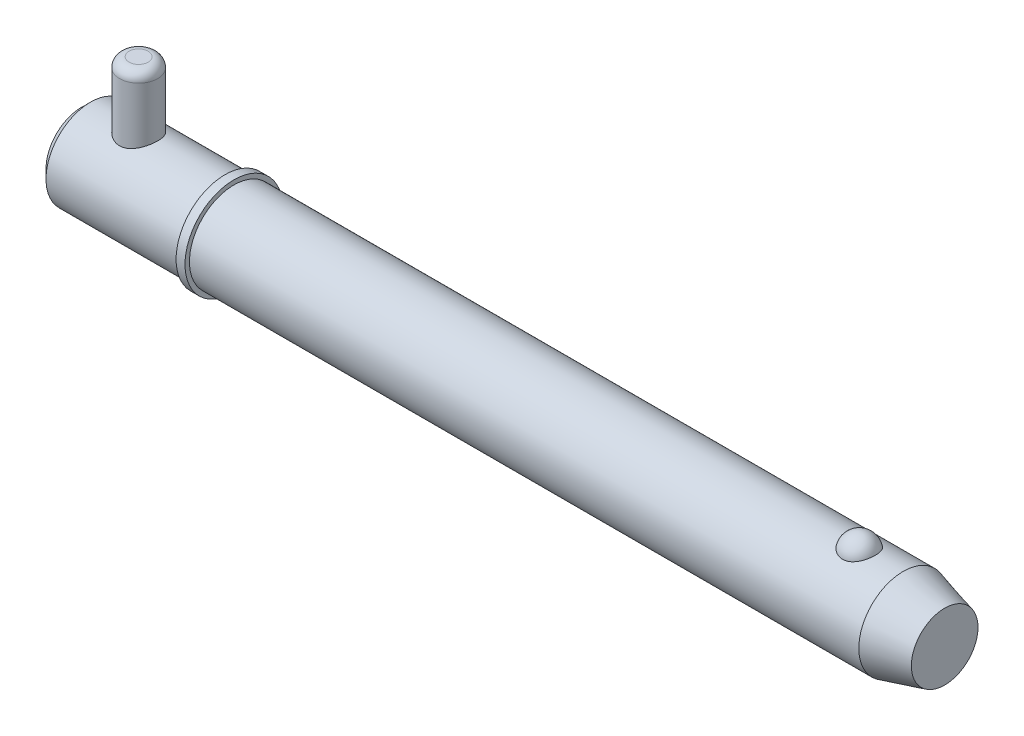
ISO-10303-21;
HEADER;
FILE_DESCRIPTION(('STEP AP214'),'2;1');
FILE_NAME('part.step','',(''),(''),'','','');
FILE_SCHEMA(('AUTOMOTIVE_DESIGN { 1 0 10303 214 1 1 1 1 }'));
ENDSEC;
DATA;
#1=APPLICATION_CONTEXT('core data for automotive mechanical design processes');
#2=APPLICATION_PROTOCOL_DEFINITION('international standard','automotive_design',2000,#1);
#3=PRODUCT_CONTEXT('',#1,'mechanical');
#4=PRODUCT('Part','Part','',(#3));
#5=PRODUCT_RELATED_PRODUCT_CATEGORY('part','',(#4));
#6=PRODUCT_DEFINITION_FORMATION('','',#4);
#7=PRODUCT_DEFINITION_CONTEXT('part definition',#1,'design');
#8=PRODUCT_DEFINITION('design','',#6,#7);
#9=PRODUCT_DEFINITION_SHAPE('','',#8);
#10=(LENGTH_UNIT() NAMED_UNIT(*) SI_UNIT(.MILLI.,.METRE.));
#11=(NAMED_UNIT(*) PLANE_ANGLE_UNIT() SI_UNIT($,.RADIAN.));
#12=(NAMED_UNIT(*) SI_UNIT($,.STERADIAN.) SOLID_ANGLE_UNIT());
#13=UNCERTAINTY_MEASURE_WITH_UNIT(LENGTH_MEASURE(1.E-05),#10,'distance_accuracy_value','');
#14=(GEOMETRIC_REPRESENTATION_CONTEXT(3) GLOBAL_UNCERTAINTY_ASSIGNED_CONTEXT((#13)) GLOBAL_UNIT_ASSIGNED_CONTEXT((#10,
#11,#12)) REPRESENTATION_CONTEXT('',''));
#15=CARTESIAN_POINT('',(0.,0.,0.));
#16=DIRECTION('',(0.,0.,1.));
#17=DIRECTION('',(1.,0.,0.));
#18=AXIS2_PLACEMENT_3D('',#15,#16,#17);
#19=CARTESIAN_POINT('',(14.28,26.985,0.));
#20=DIRECTION('',(0.,-1.,0.));
#21=DIRECTION('',(0.,0.,-1.));
#22=AXIS2_PLACEMENT_3D('',#19,#20,#21);
#23=CYLINDRICAL_SURFACE('',#22,4.76);
#24=CARTESIAN_POINT('',(14.28,-8.73500000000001,0.));
#25=DIRECTION('',(0.,1.,0.));
#26=DIRECTION('',(0.,0.,1.));
#27=AXIS2_PLACEMENT_3D('',#24,#25,#26);
#28=CIRCLE('',#27,4.76);
#29=CARTESIAN_POINT('',(14.28,-8.73500000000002,-4.76));
#30=VERTEX_POINT('',#29);
#31=EDGE_CURVE('P0_E25',#30,#30,#28,.T.);
#32=CARTESIAN_POINT('',(14.28,24.605,0.));
#33=DIRECTION('',(0.,1.,0.));
#34=DIRECTION('',(0.,0.,1.));
#35=AXIS2_PLACEMENT_3D('',#32,#33,#34);
#36=CIRCLE('',#35,4.76);
#37=CARTESIAN_POINT('',(14.28,24.605,-4.76));
#38=VERTEX_POINT('',#37);
#39=EDGE_CURVE('P0_E29',#38,#38,#36,.F.);
#40=CARTESIAN_POINT('',(14.28,-8.73500000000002,-4.76));
#41=CARTESIAN_POINT('',(14.28,-8.38770833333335,-4.76));
#42=CARTESIAN_POINT('',(14.28,-8.04041666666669,-4.76));
#43=CARTESIAN_POINT('',(14.28,-7.34583333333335,-4.76));
#44=CARTESIAN_POINT('',(14.28,-6.99854166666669,-4.76));
#45=CARTESIAN_POINT('',(14.28,-6.30395833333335,-4.76));
#46=CARTESIAN_POINT('',(14.28,-5.95666666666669,-4.76));
#47=CARTESIAN_POINT('',(14.28,-5.26208333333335,-4.76));
#48=CARTESIAN_POINT('',(14.28,-4.91479166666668,-4.76));
#49=CARTESIAN_POINT('',(14.28,-4.22020833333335,-4.76));
#50=CARTESIAN_POINT('',(14.28,-3.87291666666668,-4.76));
#51=CARTESIAN_POINT('',(14.28,-3.17833333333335,-4.76));
#52=CARTESIAN_POINT('',(14.28,-2.83104166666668,-4.76));
#53=CARTESIAN_POINT('',(14.28,-2.13645833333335,-4.76));
#54=CARTESIAN_POINT('',(14.28,-1.78916666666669,-4.76));
#55=CARTESIAN_POINT('',(14.28,-1.09458333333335,-4.76));
#56=CARTESIAN_POINT('',(14.28,-0.747291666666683,-4.76));
#57=CARTESIAN_POINT('',(14.28,-0.052708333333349,-4.76));
#58=CARTESIAN_POINT('',(14.28,0.294583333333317,-4.76));
#59=CARTESIAN_POINT('',(14.28,0.989166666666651,-4.76));
#60=CARTESIAN_POINT('',(14.28,1.33645833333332,-4.76));
#61=CARTESIAN_POINT('',(14.28,2.03104166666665,-4.76));
#62=CARTESIAN_POINT('',(14.28,2.37833333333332,-4.76));
#63=CARTESIAN_POINT('',(14.28,3.07291666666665,-4.76));
#64=CARTESIAN_POINT('',(14.28,3.42020833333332,-4.76));
#65=CARTESIAN_POINT('',(14.28,4.11479166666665,-4.76));
#66=CARTESIAN_POINT('',(14.28,4.46208333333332,-4.76));
#67=CARTESIAN_POINT('',(14.28,5.15666666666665,-4.76));
#68=CARTESIAN_POINT('',(14.28,5.50395833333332,-4.76));
#69=CARTESIAN_POINT('',(14.28,6.19854166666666,-4.76));
#70=CARTESIAN_POINT('',(14.28,6.54583333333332,-4.76));
#71=CARTESIAN_POINT('',(14.28,7.24041666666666,-4.76));
#72=CARTESIAN_POINT('',(14.28,7.58770833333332,-4.76));
#73=CARTESIAN_POINT('',(14.28,8.28229166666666,-4.76));
#74=CARTESIAN_POINT('',(14.28,8.62958333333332,-4.76));
#75=CARTESIAN_POINT('',(14.28,9.32416666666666,-4.76));
#76=CARTESIAN_POINT('',(14.28,9.67145833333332,-4.76));
#77=CARTESIAN_POINT('',(14.28,10.3660416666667,-4.76));
#78=CARTESIAN_POINT('',(14.28,10.7133333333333,-4.76));
#79=CARTESIAN_POINT('',(14.28,11.4079166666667,-4.76));
#80=CARTESIAN_POINT('',(14.28,11.7552083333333,-4.76));
#81=CARTESIAN_POINT('',(14.28,12.4497916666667,-4.76));
#82=CARTESIAN_POINT('',(14.28,12.7970833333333,-4.76));
#83=CARTESIAN_POINT('',(14.28,13.4916666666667,-4.76));
#84=CARTESIAN_POINT('',(14.28,13.8389583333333,-4.76));
#85=CARTESIAN_POINT('',(14.28,14.5335416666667,-4.76));
#86=CARTESIAN_POINT('',(14.28,14.8808333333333,-4.76));
#87=CARTESIAN_POINT('',(14.28,15.5754166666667,-4.76));
#88=CARTESIAN_POINT('',(14.28,15.9227083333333,-4.76));
#89=CARTESIAN_POINT('',(14.28,16.6172916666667,-4.76));
#90=CARTESIAN_POINT('',(14.28,16.9645833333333,-4.76));
#91=CARTESIAN_POINT('',(14.28,17.6591666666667,-4.76));
#92=CARTESIAN_POINT('',(14.28,18.0064583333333,-4.76));
#93=CARTESIAN_POINT('',(14.28,18.7010416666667,-4.76));
#94=CARTESIAN_POINT('',(14.28,19.0483333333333,-4.76));
#95=CARTESIAN_POINT('',(14.28,19.7429166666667,-4.76));
#96=CARTESIAN_POINT('',(14.28,20.0902083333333,-4.76));
#97=CARTESIAN_POINT('',(14.28,20.7847916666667,-4.76));
#98=CARTESIAN_POINT('',(14.28,21.1320833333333,-4.76));
#99=CARTESIAN_POINT('',(14.28,21.8266666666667,-4.76));
#100=CARTESIAN_POINT('',(14.28,22.1739583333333,-4.76));
#101=CARTESIAN_POINT('',(14.28,22.8685416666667,-4.76));
#102=CARTESIAN_POINT('',(14.28,23.2158333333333,-4.76));
#103=CARTESIAN_POINT('',(14.28,23.9104166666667,-4.76));
#104=CARTESIAN_POINT('',(14.28,24.2577083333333,-4.76));
#105=CARTESIAN_POINT('',(14.28,24.605,-4.76));
#106=B_SPLINE_CURVE_WITH_KNOTS('',3,(#40,#41,#42,#43,#44,#45,#46,#47,#48,#49,#50,#51,#52,#53,
#54,#55,#56,#57,#58,#59,#60,#61,#62,#63,#64,#65,#66,#67,#68,#69,#70,#71,#72,#73,#74,#75,#76,#77,
#78,#79,#80,#81,#82,#83,#84,#85,#86,#87,#88,#89,#90,#91,#92,#93,#94,#95,#96,#97,#98,#99,#100,
#101,#102,#103,#104,#105),.UNSPECIFIED.,.F.,.F.,(4,2,2,2,2,2,2,2,2,2,2,2,2,2,2,2,2,2,2,2,2,2,2,
2,2,2,2,2,2,2,2,2,4),(0.,1.041875,2.08375,3.125625,4.1675,5.209375,6.25125,7.293125,
8.33500000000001,9.376875,10.41875,11.460625,12.5025,13.544375,14.58625,15.628125,16.67,
17.711875,18.75375,19.795625,20.8375,21.879375,22.92125,23.963125,25.005,26.046875,27.08875,
28.130625,29.1725,30.214375,31.25625,32.298125,33.34),.UNSPECIFIED.);
#107=EDGE_CURVE('P0_BSEAM14',#30,#38,#106,.T.);
#108=ORIENTED_EDGE('',*,*,#31,.T.);
#109=ORIENTED_EDGE('',*,*,#39,.T.);
#110=ORIENTED_EDGE('',*,*,#107,.T.);
#111=ORIENTED_EDGE('',*,*,#107,.F.);
#112=EDGE_LOOP('',(#108,#110,#109,#111));
#113=FACE_BOUND('',#112,.T.);
#114=ADVANCED_FACE('P0_F14',(#113),#23,.T.);
#115=CARTESIAN_POINT('',(14.28,26.985,0.));
#116=DIRECTION('',(0.,1.,0.));
#117=DIRECTION('',(0.,0.,1.));
#118=AXIS2_PLACEMENT_3D('',#115,#116,#117);
#119=PLANE('',#118);
#120=CARTESIAN_POINT('',(14.28,26.985,0.));
#121=DIRECTION('',(0.,1.,0.));
#122=DIRECTION('',(0.,0.,1.));
#123=AXIS2_PLACEMENT_3D('',#120,#121,#122);
#124=CIRCLE('',#123,2.38);
#125=CARTESIAN_POINT('',(14.28,26.985,2.38));
#126=VERTEX_POINT('',#125);
#127=EDGE_CURVE('P0_E10',#126,#126,#124,.T.);
#128=ORIENTED_EDGE('',*,*,#127,.T.);
#129=EDGE_LOOP('',(#128));
#130=FACE_BOUND('',#129,.T.);
#131=ADVANCED_FACE('P0_F46',(#130),#119,.T.);
#132=CARTESIAN_POINT('',(14.28,-11.115,0.));
#133=DIRECTION('',(0.,1.,0.));
#134=DIRECTION('',(0.,0.,1.));
#135=AXIS2_PLACEMENT_3D('',#132,#133,#134);
#136=PLANE('',#135);
#137=CARTESIAN_POINT('',(14.28,-11.115,0.));
#138=DIRECTION('',(0.,1.,0.));
#139=DIRECTION('',(0.,0.,1.));
#140=AXIS2_PLACEMENT_3D('',#137,#138,#139);
#141=CIRCLE('',#140,2.38);
#142=CARTESIAN_POINT('',(14.28,-11.115,2.38));
#143=VERTEX_POINT('',#142);
#144=EDGE_CURVE('P0_E21',#143,#143,#141,.F.);
#145=ORIENTED_EDGE('',*,*,#144,.T.);
#146=EDGE_LOOP('',(#145));
#147=FACE_BOUND('',#146,.T.);
#148=ADVANCED_FACE('P0_F43',(#147),#136,.F.);
#149=CARTESIAN_POINT('',(14.28,-8.735,0.));
#150=DIRECTION('',(0.,1.,0.));
#151=DIRECTION('',(0.,0.,1.));
#152=AXIS2_PLACEMENT_3D('',#149,#150,#151);
#153=DEGENERATE_TOROIDAL_SURFACE('',#152,2.38,2.38,.T.);
#154=ORIENTED_EDGE('',*,*,#144,.F.);
#155=EDGE_LOOP('',(#154));
#156=FACE_BOUND('',#155,.T.);
#157=ORIENTED_EDGE('',*,*,#31,.F.);
#158=EDGE_LOOP('',(#157));
#159=FACE_BOUND('',#158,.T.);
#160=ADVANCED_FACE('P0_F38',(#156,#159),#153,.T.);
#161=CARTESIAN_POINT('',(14.28,24.605,0.));
#162=DIRECTION('',(0.,1.,0.));
#163=DIRECTION('',(0.,0.,1.));
#164=AXIS2_PLACEMENT_3D('',#161,#162,#163);
#165=DEGENERATE_TOROIDAL_SURFACE('',#164,2.38,2.38,.T.);
#166=ORIENTED_EDGE('',*,*,#39,.F.);
#167=EDGE_LOOP('',(#166));
#168=FACE_BOUND('',#167,.T.);
#169=ORIENTED_EDGE('',*,*,#127,.F.);
#170=EDGE_LOOP('',(#169));
#171=FACE_BOUND('',#170,.T.);
#172=ADVANCED_FACE('P0_F16',(#168,#171),#165,.T.);
#173=CLOSED_SHELL('',(#114,#131,#148,#160,#172));
#174=MANIFOLD_SOLID_BREP('P0_B1',#173);
#175=CARTESIAN_POINT('',(0.,0.,0.));
#176=DIRECTION('',(1.,0.,0.));
#177=DIRECTION('',(0.,0.,-1.));
#178=AXIS2_PLACEMENT_3D('',#175,#176,#177);
#179=CYLINDRICAL_SURFACE('',#178,11.115);
#180=CARTESIAN_POINT('',(205.529563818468,0.,0.));
#181=DIRECTION('',(1.,0.,0.));
#182=DIRECTION('',(0.,0.,-1.));
#183=AXIS2_PLACEMENT_3D('',#180,#181,#182);
#184=CIRCLE('',#183,11.115);
#185=CARTESIAN_POINT('',(205.529563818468,0.,-11.115));
#186=VERTEX_POINT('',#185);
#187=EDGE_CURVE('P1_E81',#186,#186,#184,.T.);
#188=ORIENTED_EDGE('',*,*,#187,.F.);
#189=EDGE_LOOP('',(#188));
#190=FACE_BOUND('',#189,.T.);
#191=CARTESIAN_POINT('',(38.1,0.,0.));
#192=DIRECTION('',(1.,0.,0.));
#193=DIRECTION('',(0.,0.,-1.));
#194=AXIS2_PLACEMENT_3D('',#191,#192,#193);
#195=CIRCLE('',#194,11.115);
#196=CARTESIAN_POINT('',(38.1,0.,-11.115));
#197=VERTEX_POINT('',#196);
#198=EDGE_CURVE('P1_E85',#197,#197,#195,.T.);
#199=ORIENTED_EDGE('',*,*,#198,.T.);
#200=EDGE_LOOP('',(#199));
#201=FACE_BOUND('',#200,.T.);
#202=CARTESIAN_POINT('',(194.531068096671,10.3028087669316,4.17077409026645));
#203=CARTESIAN_POINT('',(194.314775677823,10.3028003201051,4.17078240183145));
#204=CARTESIAN_POINT('',(194.098548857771,10.3098895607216,4.15340593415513));
#205=CARTESIAN_POINT('',(193.672540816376,10.3373834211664,4.08449540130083));
#206=CARTESIAN_POINT('',(193.462757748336,10.3577841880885,4.0329712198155));
#207=CARTESIAN_POINT('',(193.055782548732,10.4095237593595,3.89746513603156));
#208=CARTESIAN_POINT('',(192.858572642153,10.4408466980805,3.81353029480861));
#209=CARTESIAN_POINT('',(192.481338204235,10.5110236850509,3.61560339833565));
#210=CARTESIAN_POINT('',(192.301317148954,10.5498792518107,3.50160528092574));
#211=CARTESIAN_POINT('',(191.957684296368,10.6322884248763,3.24292464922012));
#212=CARTESIAN_POINT('',(191.794686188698,10.6759443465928,3.09746040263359));
#213=CARTESIAN_POINT('',(191.494591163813,10.7625291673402,2.78171925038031));
#214=CARTESIAN_POINT('',(191.357499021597,10.8054579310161,2.61143778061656));
#215=CARTESIAN_POINT('',(191.106408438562,10.8881935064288,2.24226695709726));
#216=CARTESIAN_POINT('',(190.993710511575,10.9277761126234,2.04244123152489));
#217=CARTESIAN_POINT('',(190.801777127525,10.997484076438,1.62578254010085));
#218=CARTESIAN_POINT('',(190.722544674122,11.0276085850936,1.40894804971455));
#219=CARTESIAN_POINT('',(190.598303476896,11.0756732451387,0.961250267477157));
#220=CARTESIAN_POINT('',(190.553760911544,11.0934470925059,0.730239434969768));
#221=CARTESIAN_POINT('',(190.501569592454,11.1143331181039,0.263439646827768));
#222=CARTESIAN_POINT('',(190.493920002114,11.1174456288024,0.0276507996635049));
#223=CARTESIAN_POINT('',(190.51561056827,11.1087161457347,-0.440729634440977));
#224=CARTESIAN_POINT('',(190.544762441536,11.0969502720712,-0.673331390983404));
#225=CARTESIAN_POINT('',(190.639143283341,11.0597872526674,-1.12996621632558));
#226=CARTESIAN_POINT('',(190.704372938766,11.0343898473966,-1.35399912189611));
#227=CARTESIAN_POINT('',(190.86969844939,10.972515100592,-1.78750286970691));
#228=CARTESIAN_POINT('',(190.96983863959,10.9360236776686,-1.99695478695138));
#229=CARTESIAN_POINT('',(191.202940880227,10.8557595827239,-2.39520667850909));
#230=CARTESIAN_POINT('',(191.335905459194,10.8119863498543,-2.58400506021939));
#231=CARTESIAN_POINT('',(191.632407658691,10.7216733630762,-2.93635726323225));
#232=CARTESIAN_POINT('',(191.796056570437,10.675123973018,-3.09981510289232));
#233=CARTESIAN_POINT('',(192.149860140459,10.5846571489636,-3.39592247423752));
#234=CARTESIAN_POINT('',(192.340012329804,10.5407394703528,-3.52857487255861));
#235=CARTESIAN_POINT('',(192.73750141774,10.4616690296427,-3.75646057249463));
#236=CARTESIAN_POINT('',(192.94436705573,10.4263443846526,-3.85245432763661));
#237=CARTESIAN_POINT('',(193.372954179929,10.3675574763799,-4.00798747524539));
#238=CARTESIAN_POINT('',(193.594670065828,10.3440907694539,-4.06754052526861));
#239=CARTESIAN_POINT('',(194.034669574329,10.3128282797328,-4.14614314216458));
#240=CARTESIAN_POINT('',(194.252565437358,10.3043040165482,-4.1670783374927));
#241=CARTESIAN_POINT('',(194.68894951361,10.3016771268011,-4.17357158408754));
#242=CARTESIAN_POINT('',(194.907437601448,10.3075716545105,-4.15913661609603));
#243=CARTESIAN_POINT('',(195.331744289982,10.3326686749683,-4.09636961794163));
#244=CARTESIAN_POINT('',(195.537745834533,10.3514555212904,-4.0490957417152));
#245=CARTESIAN_POINT('',(195.938576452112,10.399818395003,-3.92320197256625));
#246=CARTESIAN_POINT('',(196.1334046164,10.4293952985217,-3.84457953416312));
#247=CARTESIAN_POINT('',(196.511191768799,10.4969600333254,-3.65612410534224));
#248=CARTESIAN_POINT('',(196.693797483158,10.5351178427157,-3.54564545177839));
#249=CARTESIAN_POINT('',(197.038204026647,10.6154999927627,-3.29718036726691));
#250=CARTESIAN_POINT('',(197.200000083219,10.657725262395,-3.15918764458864));
#251=CARTESIAN_POINT('',(197.506959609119,10.744212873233,-2.85163580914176));
#252=CARTESIAN_POINT('',(197.650891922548,10.7884718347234,-2.68084605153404));
#253=CARTESIAN_POINT('',(197.909237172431,10.872374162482,-2.31721864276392));
#254=CARTESIAN_POINT('',(198.023644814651,10.9120167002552,-2.12437704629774));
#255=CARTESIAN_POINT('',(198.223873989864,10.9838919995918,-1.71516999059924));
#256=CARTESIAN_POINT('',(198.30866178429,11.0158465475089,-1.49824866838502));
#257=CARTESIAN_POINT('',(198.44268382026,11.0673523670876,-1.05228572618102));
#258=CARTESIAN_POINT('',(198.491917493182,11.086903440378,-0.82324391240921));
#259=CARTESIAN_POINT('',(198.553891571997,11.1116323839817,-0.359087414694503));
#260=CARTESIAN_POINT('',(198.566566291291,11.1167843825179,-0.123962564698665));
#261=CARTESIAN_POINT('',(198.554973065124,11.1121144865,0.345220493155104));
#262=CARTESIAN_POINT('',(198.530705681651,11.1022928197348,0.579278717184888));
#263=CARTESIAN_POINT('',(198.445907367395,11.0687504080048,1.03866534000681));
#264=CARTESIAN_POINT('',(198.385529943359,11.0450885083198,1.26402641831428));
#265=CARTESIAN_POINT('',(198.229853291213,10.9863185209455,1.70076772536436));
#266=CARTESIAN_POINT('',(198.134551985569,10.9512097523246,1.91214712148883));
#267=CARTESIAN_POINT('',(197.910397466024,10.8729733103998,2.316083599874));
#268=CARTESIAN_POINT('',(197.781380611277,10.8298068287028,2.50854240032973));
#269=CARTESIAN_POINT('',(197.492732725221,10.7401896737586,2.86808766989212));
#270=CARTESIAN_POINT('',(197.333102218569,10.6937390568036,3.03517457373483));
#271=CARTESIAN_POINT('',(196.987534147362,10.6029321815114,3.33857581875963));
#272=CARTESIAN_POINT('',(196.801708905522,10.5585680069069,3.47501541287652));
#273=CARTESIAN_POINT('',(196.407875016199,10.4769321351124,3.71390897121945));
#274=CARTESIAN_POINT('',(196.199863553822,10.439661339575,3.81635861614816));
#275=CARTESIAN_POINT('',(195.754066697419,10.3749407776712,3.98910631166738));
#276=CARTESIAN_POINT('',(195.515234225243,10.3482457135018,4.05700929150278));
#277=CARTESIAN_POINT('',(195.027925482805,10.312188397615,4.14782844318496));
#278=CARTESIAN_POINT('',(194.779453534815,10.3028184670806,4.17076454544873));
#279=CARTESIAN_POINT('',(194.531068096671,10.3028087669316,4.17077409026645));
#280=B_SPLINE_CURVE_WITH_KNOTS('',3,(#202,#203,#204,#205,#206,#207,#208,#209,#210,#211,#212,
#213,#214,#215,#216,#217,#218,#219,#220,#221,#222,#223,#224,#225,#226,#227,#228,#229,#230,#231,
#232,#233,#234,#235,#236,#237,#238,#239,#240,#241,#242,#243,#244,#245,#246,#247,#248,#249,#250,
#251,#252,#253,#254,#255,#256,#257,#258,#259,#260,#261,#262,#263,#264,#265,#266,#267,#268,#269,
#270,#271,#272,#273,#274,#275,#276,#277,#278,#279),.UNSPECIFIED.,.T.,.F.,(4,2,2,2,2,2,2,2,2,2,2,
2,2,2,2,2,2,2,2,2,2,2,2,2,2,2,2,2,2,2,2,2,2,2,2,2,2,2,4),(0.,0.64796614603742,1.29574482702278,
1.94258643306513,2.58955857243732,3.25496465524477,3.92049326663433,4.61566368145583,
5.31089647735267,6.01531821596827,6.71972398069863,7.42054043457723,8.12137023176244,
8.82309331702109,9.5248704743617,10.2292439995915,10.9335519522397,11.6223330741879,
12.3108558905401,12.9647664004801,13.6185478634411,14.252184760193,14.8858731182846,
15.5334360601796,16.1811472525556,16.8611459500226,17.5412664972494,18.2431855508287,
18.9451158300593,19.6483065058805,20.3514864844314,21.0516982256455,21.7519516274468,
22.4556690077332,23.1593743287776,23.8601491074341,24.5610129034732,25.3054529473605,
26.049562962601),.UNSPECIFIED.);
#281=CARTESIAN_POINT('',(194.531068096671,10.3028087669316,4.17077409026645));
#282=VERTEX_POINT('',#281);
#283=EDGE_CURVE('P1_E35',#282,#282,#280,.T.);
#284=ORIENTED_EDGE('',*,*,#283,.T.);
#285=EDGE_LOOP('',(#284));
#286=FACE_BOUND('',#285,.T.);
#287=ADVANCED_FACE('P1_F13',(#190,#201,#286),#179,.T.);
#288=CARTESIAN_POINT('',(0.,0.,0.));
#289=DIRECTION('',(-1.,0.,0.));
#290=DIRECTION('',(0.,0.,1.));
#291=AXIS2_PLACEMENT_3D('',#288,#289,#290);
#292=PLANE('',#291);
#293=CARTESIAN_POINT('',(0.,0.,0.));
#294=DIRECTION('',(1.,0.,0.));
#295=DIRECTION('',(0.,0.,-1.));
#296=AXIS2_PLACEMENT_3D('',#293,#294,#295);
#297=CIRCLE('',#296,8.892);
#298=CARTESIAN_POINT('',(0.,0.,-8.892));
#299=VERTEX_POINT('',#298);
#300=EDGE_CURVE('P1_E9',#299,#299,#297,.T.);
#301=ORIENTED_EDGE('',*,*,#300,.F.);
#302=EDGE_LOOP('',(#301));
#303=FACE_BOUND('',#302,.T.);
#304=ADVANCED_FACE('P1_F15',(#303),#292,.T.);
#305=CARTESIAN_POINT('',(2.22299999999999,0.,0.));
#306=DIRECTION('',(1.,0.,0.));
#307=DIRECTION('',(0.,0.,-1.));
#308=AXIS2_PLACEMENT_3D('',#305,#306,#307);
#309=CONICAL_SURFACE('',#308,11.115,0.78539816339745);
#310=ORIENTED_EDGE('',*,*,#300,.T.);
#311=EDGE_LOOP('',(#310));
#312=FACE_BOUND('',#311,.T.);
#313=CARTESIAN_POINT('',(2.22299999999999,0.,0.));
#314=DIRECTION('',(1.,0.,0.));
#315=DIRECTION('',(0.,0.,-1.));
#316=AXIS2_PLACEMENT_3D('',#313,#314,#315);
#317=CIRCLE('',#316,11.115);
#318=CARTESIAN_POINT('',(2.22299999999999,0.,-11.115));
#319=VERTEX_POINT('',#318);
#320=EDGE_CURVE('P1_E26',#319,#319,#317,.T.);
#321=ORIENTED_EDGE('',*,*,#320,.F.);
#322=EDGE_LOOP('',(#321));
#323=FACE_BOUND('',#322,.T.);
#324=ADVANCED_FACE('P1_F77',(#312,#323),#309,.T.);
#325=CARTESIAN_POINT('',(0.,0.,0.));
#326=DIRECTION('',(1.,0.,0.));
#327=DIRECTION('',(0.,0.,-1.));
#328=AXIS2_PLACEMENT_3D('',#325,#326,#327);
#329=CYLINDRICAL_SURFACE('',#328,11.115);
#330=CARTESIAN_POINT('',(14.28,-10.0441836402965,4.76));
#331=CARTESIAN_POINT('',(14.1533731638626,-10.0441846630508,4.75999904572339));
#332=CARTESIAN_POINT('',(14.0267055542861,-10.0465865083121,4.75493985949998));
#333=CARTESIAN_POINT('',(13.774298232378,-10.0561141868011,4.73475585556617));
#334=CARTESIAN_POINT('',(13.6485591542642,-10.0632429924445,4.71962470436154));
#335=CARTESIAN_POINT('',(13.3987500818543,-10.0819979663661,4.67942666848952));
#336=CARTESIAN_POINT('',(13.2746840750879,-10.0936334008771,4.65433930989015));
#337=CARTESIAN_POINT('',(13.0293244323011,-10.1210146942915,4.59449317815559));
#338=CARTESIAN_POINT('',(12.9080319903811,-10.1367622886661,4.55973032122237));
#339=CARTESIAN_POINT('',(12.669614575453,-10.1717810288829,4.48106435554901));
#340=CARTESIAN_POINT('',(12.5524727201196,-10.1910352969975,4.4372048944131));
#341=CARTESIAN_POINT('',(12.3224300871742,-10.2325403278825,4.34063417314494));
#342=CARTESIAN_POINT('',(12.2095309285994,-10.2547922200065,4.28791957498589));
#343=CARTESIAN_POINT('',(11.8782785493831,-10.3250879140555,4.11715127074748));
#344=CARTESIAN_POINT('',(11.6670799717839,-10.3767168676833,3.98637638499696));
#345=CARTESIAN_POINT('',(11.2564039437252,-10.4874309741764,3.68567149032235));
#346=CARTESIAN_POINT('',(11.0583793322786,-10.5467772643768,3.51386978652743));
#347=CARTESIAN_POINT('',(10.6927724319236,-10.6641377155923,3.13969960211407));
#348=CARTESIAN_POINT('',(10.5252022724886,-10.7221513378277,2.93731900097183));
#349=CARTESIAN_POINT('',(10.2965609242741,-10.8050020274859,2.60935726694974));
#350=CARTESIAN_POINT('',(10.2227768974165,-10.8324811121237,2.49310321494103));
#351=CARTESIAN_POINT('',(10.0853380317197,-10.884703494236,2.25418999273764));
#352=CARTESIAN_POINT('',(10.0216789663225,-10.9094479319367,2.13153352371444));
#353=CARTESIAN_POINT('',(9.90506238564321,-10.9554932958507,1.88060370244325));
#354=CARTESIAN_POINT('',(9.85210574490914,-10.9767939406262,1.7523298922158));
#355=CARTESIAN_POINT('',(9.75746464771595,-11.0153112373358,1.49115740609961));
#356=CARTESIAN_POINT('',(9.71577447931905,-11.0325299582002,1.35826111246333));
#357=CARTESIAN_POINT('',(9.64605475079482,-11.0615607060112,1.09614539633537));
#358=CARTESIAN_POINT('',(9.61740732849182,-11.0736151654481,0.96711700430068));
#359=CARTESIAN_POINT('',(9.57092026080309,-11.0932687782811,0.706847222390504));
#360=CARTESIAN_POINT('',(9.55307574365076,-11.1008699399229,0.575606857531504));
#361=CARTESIAN_POINT('',(9.52838640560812,-11.1114054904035,0.31192917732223));
#362=CARTESIAN_POINT('',(9.52153986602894,-11.114340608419,0.179492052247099));
#363=CARTESIAN_POINT('',(9.51892405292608,-11.1154607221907,-0.0855090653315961));
#364=CARTESIAN_POINT('',(9.52315432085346,-11.1136459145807,-0.218073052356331));
#365=CARTESIAN_POINT('',(9.542009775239,-11.1055891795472,-0.473709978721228));
#366=CARTESIAN_POINT('',(9.55594693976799,-11.099640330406,-0.596843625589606));
#367=CARTESIAN_POINT('',(9.59332832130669,-11.0837823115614,-0.841440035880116));
#368=CARTESIAN_POINT('',(9.61677567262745,-11.0738718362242,-0.962902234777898));
#369=CARTESIAN_POINT('',(9.67294089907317,-11.0503378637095,-1.20325684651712));
#370=CARTESIAN_POINT('',(9.70565569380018,-11.0367156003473,-1.32215009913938));
#371=CARTESIAN_POINT('',(9.78005008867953,-11.0060908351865,-1.55666640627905));
#372=CARTESIAN_POINT('',(9.82173311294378,-10.9890870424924,-1.67228819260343));
#373=CARTESIAN_POINT('',(9.96110379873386,-10.9330280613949,-2.01656166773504));
#374=CARTESIAN_POINT('',(10.0722987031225,-10.8892801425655,-2.23915547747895));
#375=CARTESIAN_POINT('',(10.3268588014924,-10.7934745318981,-2.66299199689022));
#376=CARTESIAN_POINT('',(10.4702355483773,-10.7414138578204,-2.86422700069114));
#377=CARTESIAN_POINT('',(10.7973904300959,-10.6296201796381,-3.25557775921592));
#378=CARTESIAN_POINT('',(10.9833705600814,-10.569604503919,-3.443774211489));
#379=CARTESIAN_POINT('',(11.3844486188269,-10.4514707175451,-3.78722133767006));
#380=CARTESIAN_POINT('',(11.5995590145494,-10.3933534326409,-3.94245783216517));
#381=CARTESIAN_POINT('',(11.9444340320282,-10.311516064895,-4.14990014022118));
#382=CARTESIAN_POINT('',(12.0654579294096,-10.2847012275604,-4.21573894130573));
#383=CARTESIAN_POINT('',(12.3132718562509,-10.2342051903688,-4.33688518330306));
#384=CARTESIAN_POINT('',(12.4400593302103,-10.2105226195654,-4.39219723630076));
#385=CARTESIAN_POINT('',(12.6985418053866,-10.1671237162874,-4.49174500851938));
#386=CARTESIAN_POINT('',(12.8302359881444,-10.1474067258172,-4.53598256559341));
#387=CARTESIAN_POINT('',(13.0975061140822,-10.1126841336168,-4.61287629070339));
#388=CARTESIAN_POINT('',(13.233079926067,-10.0976759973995,-4.64553869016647));
#389=CARTESIAN_POINT('',(13.4978553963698,-10.0737863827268,-4.6971059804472));
#390=CARTESIAN_POINT('',(13.6268754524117,-10.0645618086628,-4.716785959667));
#391=CARTESIAN_POINT('',(13.8862990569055,-10.051062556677,-4.74548419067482));
#392=CARTESIAN_POINT('',(14.0167019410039,-10.0467856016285,-4.75450734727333));
#393=CARTESIAN_POINT('',(14.277859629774,-10.0433352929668,-4.76179143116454));
#394=CARTESIAN_POINT('',(14.4086143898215,-10.0441613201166,-4.76005366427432));
#395=CARTESIAN_POINT('',(14.6694025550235,-10.0508838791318,-4.74584231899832));
#396=CARTESIAN_POINT('',(14.7994359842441,-10.0567802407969,-4.73336910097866));
#397=CARTESIAN_POINT('',(15.0487369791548,-10.0728449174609,-4.69907984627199));
#398=CARTESIAN_POINT('',(15.1681238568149,-10.0826872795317,-4.67797462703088));
#399=CARTESIAN_POINT('',(15.4045894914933,-10.1062580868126,-4.62682977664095));
#400=CARTESIAN_POINT('',(15.5216674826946,-10.1199877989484,-4.59678723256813));
#401=CARTESIAN_POINT('',(15.868278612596,-10.1664161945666,-4.49365911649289));
#402=CARTESIAN_POINT('',(16.0933756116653,-10.2043671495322,-4.40754694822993));
#403=CARTESIAN_POINT('',(16.5357981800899,-10.2919879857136,-4.19898201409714));
#404=CARTESIAN_POINT('',(16.7523611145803,-10.3420954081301,-4.07511281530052));
#405=CARTESIAN_POINT('',(17.1627188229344,-10.4477911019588,-3.7959429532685));
#406=CARTESIAN_POINT('',(17.3565033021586,-10.5033818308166,-3.64062816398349));
#407=CARTESIAN_POINT('',(17.7334034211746,-10.6196376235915,-3.28693729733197));
#408=CARTESIAN_POINT('',(17.9141276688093,-10.6803237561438,-3.08599175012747));
#409=CARTESIAN_POINT('',(18.1582189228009,-10.7666348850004,-2.76320365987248));
#410=CARTESIAN_POINT('',(18.2351223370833,-10.7946346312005,-2.65197124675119));
#411=CARTESIAN_POINT('',(18.3793967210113,-10.8483267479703,-2.42297927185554));
#412=CARTESIAN_POINT('',(18.4467718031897,-10.87402011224,-2.30522255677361));
#413=CARTESIAN_POINT('',(18.5717669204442,-10.9225249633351,-2.06324665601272));
#414=CARTESIAN_POINT('',(18.6293326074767,-10.9453202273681,-1.93899615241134));
#415=CARTESIAN_POINT('',(18.73370006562,-10.9872100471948,-1.6855059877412));
#416=CARTESIAN_POINT('',(18.7805065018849,-11.0063062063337,-1.55626851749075));
#417=CARTESIAN_POINT('',(18.8628731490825,-11.0402419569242,-1.29375150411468));
#418=CARTESIAN_POINT('',(18.8984366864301,-11.0550828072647,-1.16047316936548));
#419=CARTESIAN_POINT('',(18.9579183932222,-11.0800638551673,-0.890912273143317));
#420=CARTESIAN_POINT('',(18.9818374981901,-11.0902044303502,-0.75462995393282));
#421=CARTESIAN_POINT('',(19.0164177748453,-11.104911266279,-0.490295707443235));
#422=CARTESIAN_POINT('',(19.027922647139,-11.1098318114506,-0.362373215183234));
#423=CARTESIAN_POINT('',(19.040554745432,-11.1152360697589,-0.105876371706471));
#424=CARTESIAN_POINT('',(19.0416784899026,-11.1157182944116,0.0226981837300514));
#425=CARTESIAN_POINT('',(19.0335275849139,-11.1122291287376,0.27938352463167));
#426=CARTESIAN_POINT('',(19.0242587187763,-11.1082602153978,0.407494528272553));
#427=CARTESIAN_POINT('',(18.9954320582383,-11.0959792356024,0.662388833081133));
#428=CARTESIAN_POINT('',(18.9758704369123,-11.0876655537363,0.789171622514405));
#429=CARTESIAN_POINT('',(18.9276379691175,-11.0673259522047,1.03545890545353));
#430=CARTESIAN_POINT('',(18.8993573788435,-11.0554596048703,1.15505309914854));
#431=CARTESIAN_POINT('',(18.8337694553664,-11.0282166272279,1.39134516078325));
#432=CARTESIAN_POINT('',(18.7964589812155,-11.0128387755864,1.5080420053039));
#433=CARTESIAN_POINT('',(18.671464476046,-10.9619666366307,1.85262797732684));
#434=CARTESIAN_POINT('',(18.5706772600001,-10.9217161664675,2.07521484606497));
#435=CARTESIAN_POINT('',(18.33202463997,-10.8301378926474,2.51061719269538));
#436=CARTESIAN_POINT('',(18.1926775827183,-10.7783885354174,2.72252375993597));
#437=CARTESIAN_POINT('',(17.8829747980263,-10.669863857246,3.12088015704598));
#438=CARTESIAN_POINT('',(17.7126068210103,-10.6130865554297,3.30731987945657));
#439=CARTESIAN_POINT('',(17.3310036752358,-10.495668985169,3.66358491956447));
#440=CARTESIAN_POINT('',(17.1177010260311,-10.4350471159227,3.83122543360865));
#441=CARTESIAN_POINT('',(16.7778915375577,-10.3495418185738,4.05420569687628));
#442=CARTESIAN_POINT('',(16.6612023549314,-10.3219229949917,4.12383380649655));
#443=CARTESIAN_POINT('',(16.4218466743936,-10.2693487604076,4.25306463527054));
#444=CARTESIAN_POINT('',(16.2991829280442,-10.2443921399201,4.31267191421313));
#445=CARTESIAN_POINT('',(16.0488008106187,-10.1979981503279,4.42126071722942));
#446=CARTESIAN_POINT('',(15.9210894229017,-10.1765561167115,4.47025635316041));
#447=CARTESIAN_POINT('',(15.6613937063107,-10.1379191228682,4.55720152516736));
#448=CARTESIAN_POINT('',(15.5294115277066,-10.1207220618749,4.59515652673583));
#449=CARTESIAN_POINT('',(15.2624981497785,-10.091252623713,4.65951684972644));
#450=CARTESIAN_POINT('',(15.1275757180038,-10.0789672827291,4.68595259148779));
#451=CARTESIAN_POINT('',(14.8556442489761,-10.0597530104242,4.72706206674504));
#452=CARTESIAN_POINT('',(14.7186368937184,-10.0528199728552,4.74174481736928));
#453=CARTESIAN_POINT('',(14.5310955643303,-10.047196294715,4.75363843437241));
#454=CARTESIAN_POINT('',(14.48091543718,-10.0460674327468,4.75602323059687));
#455=CARTESIAN_POINT('',(14.3804923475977,-10.044560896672,4.7592042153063));
#456=CARTESIAN_POINT('',(14.3302493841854,-10.0441832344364,4.76000037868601));
#457=CARTESIAN_POINT('',(14.28,-10.0441836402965,4.76));
#458=B_SPLINE_CURVE_WITH_KNOTS('',3,(#330,#331,#332,#333,#334,#335,#336,#337,#338,#339,#340,
#341,#342,#343,#344,#345,#346,#347,#348,#349,#350,#351,#352,#353,#354,#355,#356,#357,#358,#359,
#360,#361,#362,#363,#364,#365,#366,#367,#368,#369,#370,#371,#372,#373,#374,#375,#376,#377,#378,
#379,#380,#381,#382,#383,#384,#385,#386,#387,#388,#389,#390,#391,#392,#393,#394,#395,#396,#397,
#398,#399,#400,#401,#402,#403,#404,#405,#406,#407,#408,#409,#410,#411,#412,#413,#414,#415,#416,
#417,#418,#419,#420,#421,#422,#423,#424,#425,#426,#427,#428,#429,#430,#431,#432,#433,#434,#435,
#436,#437,#438,#439,#440,#441,#442,#443,#444,#445,#446,#447,#448,#449,#450,#451,#452,#453,#454,
#455,#456,#457),.UNSPECIFIED.,.T.,.F.,(4,2,2,2,2,2,2,2,2,2,2,2,2,2,2,2,2,2,2,2,2,2,2,2,2,2,2,2,
2,2,2,2,2,2,2,2,2,2,2,2,2,2,2,2,2,2,2,2,2,2,2,2,2,2,2,2,2,2,2,2,2,2,2,4),(0.,0.379828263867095,
0.759895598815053,1.14074858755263,1.52176256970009,1.90098898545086,2.28035867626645,
3.03818035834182,3.84125131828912,4.6446414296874,5.06541657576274,5.48601561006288,
5.90664899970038,6.3270687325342,6.72470503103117,7.12216187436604,7.51955659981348,
7.91693487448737,8.28868404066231,8.66055582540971,9.03230414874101,9.40419465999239,
10.1585834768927,10.9132435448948,11.7236471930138,12.5343987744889,12.9550196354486,
13.3754557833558,13.7958221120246,14.2159617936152,14.6079540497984,14.9997658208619,
15.3915300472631,15.7832811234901,16.1477615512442,16.512360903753,17.240999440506,
18.0012974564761,18.761937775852,19.5886929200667,20.0025782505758,20.4162843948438,
20.832212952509,21.2479608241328,21.6635855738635,22.0791769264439,22.4642880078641,
22.8495282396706,23.2345541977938,23.6197234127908,23.9896813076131,24.3597680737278,
25.099327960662,25.8726239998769,26.6462260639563,27.4759193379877,27.8914891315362,
28.3068693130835,28.7216936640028,29.1363123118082,29.5498292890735,29.9630287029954,
30.113753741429,30.2644811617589),.UNSPECIFIED.);
#459=CARTESIAN_POINT('',(14.28,-10.0441836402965,4.76));
#460=VERTEX_POINT('',#459);
#461=EDGE_CURVE('P1_E17',#460,#460,#458,.T.);
#462=ORIENTED_EDGE('',*,*,#461,.F.);
#463=EDGE_LOOP('',(#462));
#464=FACE_BOUND('',#463,.T.);
#465=CARTESIAN_POINT('',(14.28,10.0441836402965,4.76));
#466=CARTESIAN_POINT('',(14.4066268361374,10.0441846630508,4.75999904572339));
#467=CARTESIAN_POINT('',(14.5332944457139,10.0465865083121,4.75493985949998));
#468=CARTESIAN_POINT('',(14.785701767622,10.0561141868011,4.73475585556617));
#469=CARTESIAN_POINT('',(14.9114408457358,10.0632429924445,4.71962470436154));
#470=CARTESIAN_POINT('',(15.1612499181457,10.0819979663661,4.67942666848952));
#471=CARTESIAN_POINT('',(15.2853159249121,10.0936334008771,4.65433930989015));
#472=CARTESIAN_POINT('',(15.5306755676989,10.1210146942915,4.59449317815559));
#473=CARTESIAN_POINT('',(15.6519680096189,10.1367622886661,4.55973032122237));
#474=CARTESIAN_POINT('',(15.890385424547,10.1717810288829,4.48106435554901));
#475=CARTESIAN_POINT('',(16.0075272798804,10.1910352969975,4.4372048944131));
#476=CARTESIAN_POINT('',(16.2375699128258,10.2325403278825,4.34063417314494));
#477=CARTESIAN_POINT('',(16.3504690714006,10.2547922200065,4.28791957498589));
#478=CARTESIAN_POINT('',(16.6817214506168,10.3250879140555,4.11715127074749));
#479=CARTESIAN_POINT('',(16.8929200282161,10.3767168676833,3.98637638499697));
#480=CARTESIAN_POINT('',(17.3035960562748,10.4874309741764,3.68567149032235));
#481=CARTESIAN_POINT('',(17.5016206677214,10.5467772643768,3.51386978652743));
#482=CARTESIAN_POINT('',(17.8672275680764,10.6641377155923,3.13969960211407));
#483=CARTESIAN_POINT('',(18.0347977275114,10.7221513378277,2.93731900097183));
#484=CARTESIAN_POINT('',(18.2634390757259,10.8050020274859,2.60935726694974));
#485=CARTESIAN_POINT('',(18.3372231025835,10.8324811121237,2.49310321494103));
#486=CARTESIAN_POINT('',(18.4746619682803,10.884703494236,2.25418999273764));
#487=CARTESIAN_POINT('',(18.5383210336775,10.9094479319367,2.13153352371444));
#488=CARTESIAN_POINT('',(18.6549376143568,10.9554932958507,1.88060370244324));
#489=CARTESIAN_POINT('',(18.7078942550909,10.9767939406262,1.75232989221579));
#490=CARTESIAN_POINT('',(18.8025353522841,11.0153112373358,1.4911574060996));
#491=CARTESIAN_POINT('',(18.844225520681,11.0325299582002,1.35826111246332));
#492=CARTESIAN_POINT('',(18.9139452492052,11.0615607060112,1.09614539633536));
#493=CARTESIAN_POINT('',(18.9425926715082,11.0736151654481,0.967117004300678));
#494=CARTESIAN_POINT('',(18.9890797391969,11.0932687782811,0.706847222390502));
#495=CARTESIAN_POINT('',(19.0069242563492,11.1008699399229,0.575606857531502));
#496=CARTESIAN_POINT('',(19.0316135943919,11.1114054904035,0.311929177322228));
#497=CARTESIAN_POINT('',(19.0384601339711,11.114340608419,0.179492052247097));
#498=CARTESIAN_POINT('',(19.0410759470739,11.1154607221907,-0.0855090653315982));
#499=CARTESIAN_POINT('',(19.0368456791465,11.1136459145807,-0.218073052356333));
#500=CARTESIAN_POINT('',(19.017990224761,11.1055891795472,-0.47370997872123));
#501=CARTESIAN_POINT('',(19.004053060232,11.099640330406,-0.596843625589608));
#502=CARTESIAN_POINT('',(18.9666716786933,11.0837823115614,-0.841440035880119));
#503=CARTESIAN_POINT('',(18.9432243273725,11.0738718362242,-0.9629022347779));
#504=CARTESIAN_POINT('',(18.8870591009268,11.0503378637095,-1.20325684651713));
#505=CARTESIAN_POINT('',(18.8543443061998,11.0367156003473,-1.32215009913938));
#506=CARTESIAN_POINT('',(18.7799499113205,11.0060908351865,-1.55666640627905));
#507=CARTESIAN_POINT('',(18.7382668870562,10.9890870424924,-1.67228819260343));
#508=CARTESIAN_POINT('',(18.5988962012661,10.9330280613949,-2.01656166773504));
#509=CARTESIAN_POINT('',(18.4877012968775,10.8892801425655,-2.23915547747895));
#510=CARTESIAN_POINT('',(18.2331411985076,10.7934745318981,-2.66299199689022));
#511=CARTESIAN_POINT('',(18.0897644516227,10.7414138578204,-2.86422700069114));
#512=CARTESIAN_POINT('',(17.7626095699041,10.6296201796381,-3.25557775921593));
#513=CARTESIAN_POINT('',(17.5766294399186,10.569604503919,-3.443774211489));
#514=CARTESIAN_POINT('',(17.1755513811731,10.4514707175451,-3.78722133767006));
#515=CARTESIAN_POINT('',(16.9604409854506,10.3933534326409,-3.94245783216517));
#516=CARTESIAN_POINT('',(16.6155659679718,10.311516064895,-4.14990014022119));
#517=CARTESIAN_POINT('',(16.4945420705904,10.2847012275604,-4.21573894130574));
#518=CARTESIAN_POINT('',(16.2467281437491,10.2342051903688,-4.33688518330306));
#519=CARTESIAN_POINT('',(16.1199406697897,10.2105226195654,-4.39219723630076));
#520=CARTESIAN_POINT('',(15.8614581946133,10.1671237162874,-4.49174500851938));
#521=CARTESIAN_POINT('',(15.7297640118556,10.1474067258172,-4.53598256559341));
#522=CARTESIAN_POINT('',(15.4624938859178,10.1126841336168,-4.61287629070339));
#523=CARTESIAN_POINT('',(15.326920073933,10.0976759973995,-4.64553869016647));
#524=CARTESIAN_POINT('',(15.0621446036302,10.0737863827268,-4.6971059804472));
#525=CARTESIAN_POINT('',(14.9331245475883,10.0645618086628,-4.716785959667));
#526=CARTESIAN_POINT('',(14.6737009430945,10.051062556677,-4.74548419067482));
#527=CARTESIAN_POINT('',(14.543298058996,10.0467856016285,-4.75450734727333));
#528=CARTESIAN_POINT('',(14.2821403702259,10.0433352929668,-4.76179143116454));
#529=CARTESIAN_POINT('',(14.1513856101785,10.0441613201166,-4.76005366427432));
#530=CARTESIAN_POINT('',(13.8905974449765,10.0508838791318,-4.74584231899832));
#531=CARTESIAN_POINT('',(13.7605640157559,10.0567802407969,-4.73336910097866));
#532=CARTESIAN_POINT('',(13.5112630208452,10.0728449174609,-4.69907984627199));
#533=CARTESIAN_POINT('',(13.3918761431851,10.0826872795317,-4.67797462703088));
#534=CARTESIAN_POINT('',(13.1554105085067,10.1062580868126,-4.62682977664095));
#535=CARTESIAN_POINT('',(13.0383325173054,10.1199877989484,-4.59678723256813));
#536=CARTESIAN_POINT('',(12.691721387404,10.1664161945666,-4.49365911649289));
#537=CARTESIAN_POINT('',(12.4666243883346,10.2043671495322,-4.40754694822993));
#538=CARTESIAN_POINT('',(12.0242018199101,10.2919879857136,-4.19898201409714));
#539=CARTESIAN_POINT('',(11.8076388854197,10.3420954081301,-4.07511281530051));
#540=CARTESIAN_POINT('',(11.3972811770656,10.4477911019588,-3.7959429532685));
#541=CARTESIAN_POINT('',(11.2034966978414,10.5033818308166,-3.64062816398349));
#542=CARTESIAN_POINT('',(10.8265965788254,10.6196376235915,-3.28693729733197));
#543=CARTESIAN_POINT('',(10.6458723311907,10.6803237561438,-3.08599175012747));
#544=CARTESIAN_POINT('',(10.4017810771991,10.7666348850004,-2.76320365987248));
#545=CARTESIAN_POINT('',(10.3248776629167,10.7946346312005,-2.65197124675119));
#546=CARTESIAN_POINT('',(10.1806032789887,10.8483267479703,-2.42297927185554));
#547=CARTESIAN_POINT('',(10.1132281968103,10.87402011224,-2.30522255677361));
#548=CARTESIAN_POINT('',(9.98823307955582,10.9225249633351,-2.06324665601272));
#549=CARTESIAN_POINT('',(9.93066739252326,10.9453202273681,-1.93899615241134));
#550=CARTESIAN_POINT('',(9.82629993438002,10.9872100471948,-1.6855059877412));
#551=CARTESIAN_POINT('',(9.77949349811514,11.0063062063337,-1.55626851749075));
#552=CARTESIAN_POINT('',(9.69712685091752,11.0402419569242,-1.29375150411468));
#553=CARTESIAN_POINT('',(9.66156331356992,11.0550828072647,-1.16047316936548));
#554=CARTESIAN_POINT('',(9.60208160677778,11.0800638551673,-0.890912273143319));
#555=CARTESIAN_POINT('',(9.57816250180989,11.0902044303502,-0.754629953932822));
#556=CARTESIAN_POINT('',(9.54358222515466,11.104911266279,-0.490295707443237));
#557=CARTESIAN_POINT('',(9.53207735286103,11.1098318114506,-0.362373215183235));
#558=CARTESIAN_POINT('',(9.51944525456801,11.1152360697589,-0.105876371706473));
#559=CARTESIAN_POINT('',(9.51832151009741,11.1157182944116,0.0226981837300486));
#560=CARTESIAN_POINT('',(9.52647241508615,11.1122291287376,0.279383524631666));
#561=CARTESIAN_POINT('',(9.53574128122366,11.1082602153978,0.407494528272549));
#562=CARTESIAN_POINT('',(9.5645679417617,11.0959792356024,0.662388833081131));
#563=CARTESIAN_POINT('',(9.58412956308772,11.0876655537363,0.789171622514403));
#564=CARTESIAN_POINT('',(9.63236203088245,11.0673259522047,1.03545890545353));
#565=CARTESIAN_POINT('',(9.66064262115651,11.0554596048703,1.15505309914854));
#566=CARTESIAN_POINT('',(9.72623054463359,11.0282166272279,1.39134516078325));
#567=CARTESIAN_POINT('',(9.76354101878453,11.0128387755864,1.5080420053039));
#568=CARTESIAN_POINT('',(9.88853552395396,10.9619666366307,1.85262797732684));
#569=CARTESIAN_POINT('',(9.98932273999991,10.9217161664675,2.07521484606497));
#570=CARTESIAN_POINT('',(10.22797536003,10.8301378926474,2.51061719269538));
#571=CARTESIAN_POINT('',(10.3673224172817,10.7783885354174,2.72252375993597));
#572=CARTESIAN_POINT('',(10.6770252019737,10.669863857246,3.12088015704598));
#573=CARTESIAN_POINT('',(10.8473931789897,10.6130865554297,3.30731987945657));
#574=CARTESIAN_POINT('',(11.2289963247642,10.495668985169,3.66358491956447));
#575=CARTESIAN_POINT('',(11.4422989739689,10.4350471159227,3.83122543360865));
#576=CARTESIAN_POINT('',(11.7821084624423,10.3495418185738,4.05420569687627));
#577=CARTESIAN_POINT('',(11.8987976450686,10.3219229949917,4.12383380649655));
#578=CARTESIAN_POINT('',(12.1381533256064,10.2693487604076,4.25306463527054));
#579=CARTESIAN_POINT('',(12.2608170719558,10.2443921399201,4.31267191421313));
#580=CARTESIAN_POINT('',(12.5111991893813,10.1979981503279,4.42126071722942));
#581=CARTESIAN_POINT('',(12.6389105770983,10.1765561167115,4.47025635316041));
#582=CARTESIAN_POINT('',(12.8986062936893,10.1379191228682,4.55720152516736));
#583=CARTESIAN_POINT('',(13.0305884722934,10.1207220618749,4.59515652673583));
#584=CARTESIAN_POINT('',(13.2975018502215,10.091252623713,4.65951684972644));
#585=CARTESIAN_POINT('',(13.4324242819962,10.0789672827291,4.68595259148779));
#586=CARTESIAN_POINT('',(13.7043557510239,10.0597530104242,4.72706206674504));
#587=CARTESIAN_POINT('',(13.8413631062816,10.0528199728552,4.74174481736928));
#588=CARTESIAN_POINT('',(14.0289044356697,10.047196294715,4.75363843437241));
#589=CARTESIAN_POINT('',(14.07908456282,10.0460674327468,4.75602323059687));
#590=CARTESIAN_POINT('',(14.1795076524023,10.044560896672,4.7592042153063));
#591=CARTESIAN_POINT('',(14.2297506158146,10.0441832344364,4.76000037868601));
#592=CARTESIAN_POINT('',(14.28,10.0441836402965,4.76));
#593=B_SPLINE_CURVE_WITH_KNOTS('',3,(#465,#466,#467,#468,#469,#470,#471,#472,#473,#474,#475,
#476,#477,#478,#479,#480,#481,#482,#483,#484,#485,#486,#487,#488,#489,#490,#491,#492,#493,#494,
#495,#496,#497,#498,#499,#500,#501,#502,#503,#504,#505,#506,#507,#508,#509,#510,#511,#512,#513,
#514,#515,#516,#517,#518,#519,#520,#521,#522,#523,#524,#525,#526,#527,#528,#529,#530,#531,#532,
#533,#534,#535,#536,#537,#538,#539,#540,#541,#542,#543,#544,#545,#546,#547,#548,#549,#550,#551,
#552,#553,#554,#555,#556,#557,#558,#559,#560,#561,#562,#563,#564,#565,#566,#567,#568,#569,#570,
#571,#572,#573,#574,#575,#576,#577,#578,#579,#580,#581,#582,#583,#584,#585,#586,#587,#588,#589,
#590,#591,#592),.UNSPECIFIED.,.T.,.F.,(4,2,2,2,2,2,2,2,2,2,2,2,2,2,2,2,2,2,2,2,2,2,2,2,2,2,2,2,
2,2,2,2,2,2,2,2,2,2,2,2,2,2,2,2,2,2,2,2,2,2,2,2,2,2,2,2,2,2,2,2,2,2,2,4),(0.,0.379828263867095,
0.759895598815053,1.14074858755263,1.52176256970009,1.90098898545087,2.28035867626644,
3.03818035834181,3.84125131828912,4.6446414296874,5.06541657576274,5.48601561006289,
5.90664899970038,6.3270687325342,6.72470503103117,7.12216187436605,7.51955659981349,
7.91693487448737,8.28868404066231,8.66055582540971,9.03230414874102,9.4041946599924,
10.1585834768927,10.9132435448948,11.7236471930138,12.5343987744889,12.9550196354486,
13.3754557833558,13.7958221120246,14.2159617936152,14.6079540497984,14.9997658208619,
15.3915300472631,15.7832811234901,16.1477615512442,16.512360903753,17.240999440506,
18.0012974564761,18.761937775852,19.5886929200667,20.0025782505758,20.4162843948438,
20.832212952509,21.2479608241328,21.6635855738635,22.0791769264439,22.4642880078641,
22.8495282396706,23.2345541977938,23.6197234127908,23.9896813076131,24.3597680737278,
25.099327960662,25.8726239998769,26.6462260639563,27.4759193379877,27.8914891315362,
28.3068693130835,28.7216936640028,29.1363123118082,29.5498292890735,29.9630287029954,
30.113753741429,30.2644811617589),.UNSPECIFIED.);
#594=CARTESIAN_POINT('',(14.28,10.0441836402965,4.76));
#595=VERTEX_POINT('',#594);
#596=EDGE_CURVE('P1_E43',#595,#595,#593,.T.);
#597=ORIENTED_EDGE('',*,*,#596,.F.);
#598=EDGE_LOOP('',(#597));
#599=FACE_BOUND('',#598,.T.);
#600=ORIENTED_EDGE('',*,*,#320,.T.);
#601=EDGE_LOOP('',(#600));
#602=FACE_BOUND('',#601,.T.);
#603=CARTESIAN_POINT('',(35.877,0.,0.));
#604=DIRECTION('',(1.,0.,0.));
#605=DIRECTION('',(0.,0.,-1.));
#606=AXIS2_PLACEMENT_3D('',#603,#604,#605);
#607=CIRCLE('',#606,11.115);
#608=CARTESIAN_POINT('',(35.877,0.,-11.115));
#609=VERTEX_POINT('',#608);
#610=EDGE_CURVE('P1_E31',#609,#609,#607,.T.);
#611=ORIENTED_EDGE('',*,*,#610,.F.);
#612=EDGE_LOOP('',(#611));
#613=FACE_BOUND('',#612,.T.);
#614=ADVANCED_FACE('P1_F103',(#464,#599,#602,#613),#329,.T.);
#615=CARTESIAN_POINT('',(35.877,11.115,0.));
#616=DIRECTION('',(-1.,0.,0.));
#617=DIRECTION('',(0.,0.,1.));
#618=AXIS2_PLACEMENT_3D('',#615,#616,#617);
#619=PLANE('',#618);
#620=ORIENTED_EDGE('',*,*,#610,.T.);
#621=EDGE_LOOP('',(#620));
#622=FACE_BOUND('',#621,.T.);
#623=CARTESIAN_POINT('',(35.877,0.,0.));
#624=DIRECTION('',(1.,0.,0.));
#625=DIRECTION('',(0.,0.,-1.));
#626=AXIS2_PLACEMENT_3D('',#623,#624,#625);
#627=CIRCLE('',#626,12.2265);
#628=CARTESIAN_POINT('',(35.877,0.,-12.2265));
#629=VERTEX_POINT('',#628);
#630=EDGE_CURVE('P1_E91',#629,#629,#627,.T.);
#631=ORIENTED_EDGE('',*,*,#630,.F.);
#632=EDGE_LOOP('',(#631));
#633=FACE_BOUND('',#632,.T.);
#634=ADVANCED_FACE('P1_F100',(#622,#633),#619,.T.);
#635=CARTESIAN_POINT('',(0.,0.,0.));
#636=DIRECTION('',(1.,0.,0.));
#637=DIRECTION('',(0.,0.,-1.));
#638=AXIS2_PLACEMENT_3D('',#635,#636,#637);
#639=CYLINDRICAL_SURFACE('',#638,12.2265);
#640=ORIENTED_EDGE('',*,*,#630,.T.);
#641=EDGE_LOOP('',(#640));
#642=FACE_BOUND('',#641,.T.);
#643=CARTESIAN_POINT('',(38.1,0.,0.));
#644=DIRECTION('',(1.,0.,0.));
#645=DIRECTION('',(0.,0.,-1.));
#646=AXIS2_PLACEMENT_3D('',#643,#644,#645);
#647=CIRCLE('',#646,12.2265);
#648=CARTESIAN_POINT('',(38.1,0.,-12.2265));
#649=VERTEX_POINT('',#648);
#650=EDGE_CURVE('P1_E88',#649,#649,#647,.T.);
#651=ORIENTED_EDGE('',*,*,#650,.F.);
#652=EDGE_LOOP('',(#651));
#653=FACE_BOUND('',#652,.T.);
#654=ADVANCED_FACE('P1_F68',(#642,#653),#639,.T.);
#655=CARTESIAN_POINT('',(38.1,12.2265,0.));
#656=DIRECTION('',(1.,0.,0.));
#657=DIRECTION('',(0.,0.,-1.));
#658=AXIS2_PLACEMENT_3D('',#655,#656,#657);
#659=PLANE('',#658);
#660=ORIENTED_EDGE('',*,*,#650,.T.);
#661=EDGE_LOOP('',(#660));
#662=FACE_BOUND('',#661,.T.);
#663=ORIENTED_EDGE('',*,*,#198,.F.);
#664=EDGE_LOOP('',(#663));
#665=FACE_BOUND('',#664,.T.);
#666=ADVANCED_FACE('P1_F62',(#662,#665),#659,.T.);
#667=CARTESIAN_POINT('',(215.9,0.,0.));
#668=DIRECTION('',(-1.,0.,0.));
#669=DIRECTION('',(0.,0.,1.));
#670=AXIS2_PLACEMENT_3D('',#667,#668,#669);
#671=CONICAL_SURFACE('',#670,8.33625000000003,0.261799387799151);
#672=ORIENTED_EDGE('',*,*,#187,.T.);
#673=EDGE_LOOP('',(#672));
#674=FACE_BOUND('',#673,.T.);
#675=CARTESIAN_POINT('',(215.9,0.,0.));
#676=DIRECTION('',(1.,0.,0.));
#677=DIRECTION('',(0.,0.,-1.));
#678=AXIS2_PLACEMENT_3D('',#675,#676,#677);
#679=CIRCLE('',#678,8.33625000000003);
#680=CARTESIAN_POINT('',(215.9,0.,-8.33625000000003));
#681=VERTEX_POINT('',#680);
#682=EDGE_CURVE('P1_E42',#681,#681,#679,.T.);
#683=ORIENTED_EDGE('',*,*,#682,.F.);
#684=EDGE_LOOP('',(#683));
#685=FACE_BOUND('',#684,.T.);
#686=ADVANCED_FACE('P1_F59',(#674,#685),#671,.T.);
#687=CARTESIAN_POINT('',(215.9,8.33625000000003,0.));
#688=DIRECTION('',(1.,0.,0.));
#689=DIRECTION('',(0.,0.,-1.));
#690=AXIS2_PLACEMENT_3D('',#687,#688,#689);
#691=PLANE('',#690);
#692=ORIENTED_EDGE('',*,*,#682,.T.);
#693=EDGE_LOOP('',(#692));
#694=FACE_BOUND('',#693,.T.);
#695=ADVANCED_FACE('P1_F55',(#694),#691,.T.);
#696=CARTESIAN_POINT('',(194.531068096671,10.0035,0.));
#697=DIRECTION('',(-1.,0.,0.));
#698=DIRECTION('',(0.,-1.,0.));
#699=AXIS2_PLACEMENT_3D('',#696,#697,#698);
#700=SPHERICAL_SURFACE('',#699,4.18150000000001);
#701=ORIENTED_EDGE('',*,*,#283,.F.);
#702=EDGE_LOOP('',(#701));
#703=FACE_BOUND('',#702,.T.);
#704=ADVANCED_FACE('P1_F50',(#703),#700,.T.);
#705=CARTESIAN_POINT('',(14.28,-12.2265,0.));
#706=DIRECTION('',(0.,1.,0.));
#707=DIRECTION('',(0.,0.,1.));
#708=AXIS2_PLACEMENT_3D('',#705,#706,#707);
#709=CYLINDRICAL_SURFACE('',#708,4.76);
#710=ORIENTED_EDGE('',*,*,#461,.T.);
#711=EDGE_LOOP('',(#710));
#712=FACE_BOUND('',#711,.T.);
#713=ORIENTED_EDGE('',*,*,#596,.T.);
#714=EDGE_LOOP('',(#713));
#715=FACE_BOUND('',#714,.T.);
#716=ADVANCED_FACE('P1_F54',(#712,#715),#709,.F.);
#717=CLOSED_SHELL('',(#287,#304,#324,#614,#634,#654,#666,#686,#695,#704,#716));
#718=MANIFOLD_SOLID_BREP('P1_B1',#717);
#719=ADVANCED_BREP_SHAPE_REPRESENTATION('',(#18,#174,#718),#14);
#720=SHAPE_DEFINITION_REPRESENTATION(#9,#719);
ENDSEC;
END-ISO-10303-21;
